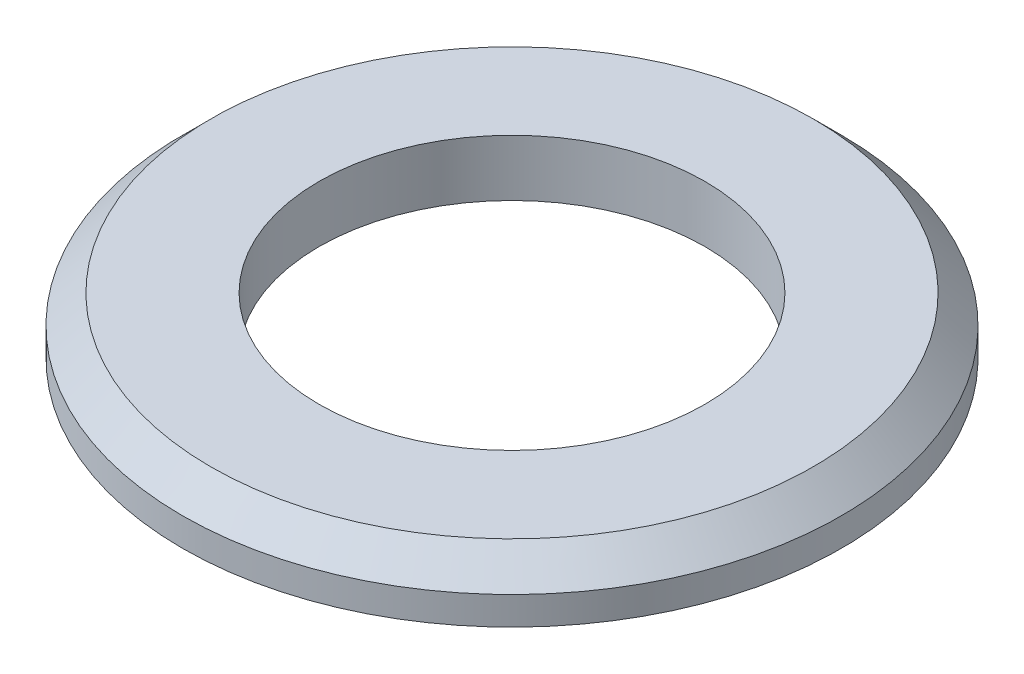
from build123d import *

# Parameters (mm, degrees)
SKETCH1_R      = 70
SKETCH1_R_2    = 41
EXTRUDE1_DEPTH = 12
CHAMFER1_SIZE  = 6


with BuildPart() as part:
    # Sketch1 → Extrude1 (new body)
    with BuildSketch(Plane(origin=(0, 0, 0), x_dir=(1, 0, 0), z_dir=(0, 1, 0))):
        with Locations(Location((0, 0, 0), (0, 0, 270))):
            Circle(SKETCH1_R)
        with Locations(Location((0, 0, 0), (0, 0, 270))):
            Circle(SKETCH1_R_2, mode=Mode.SUBTRACT)
    extrude(amount=EXTRUDE1_DEPTH)

    # Chamfer1
    chamfer1_edges = [part.edges().sort_by_distance(p)[0] for p in [
        (0, 12, -70),
    ]]
    chamfer(chamfer1_edges, length=CHAMFER1_SIZE)


solid = part.part
